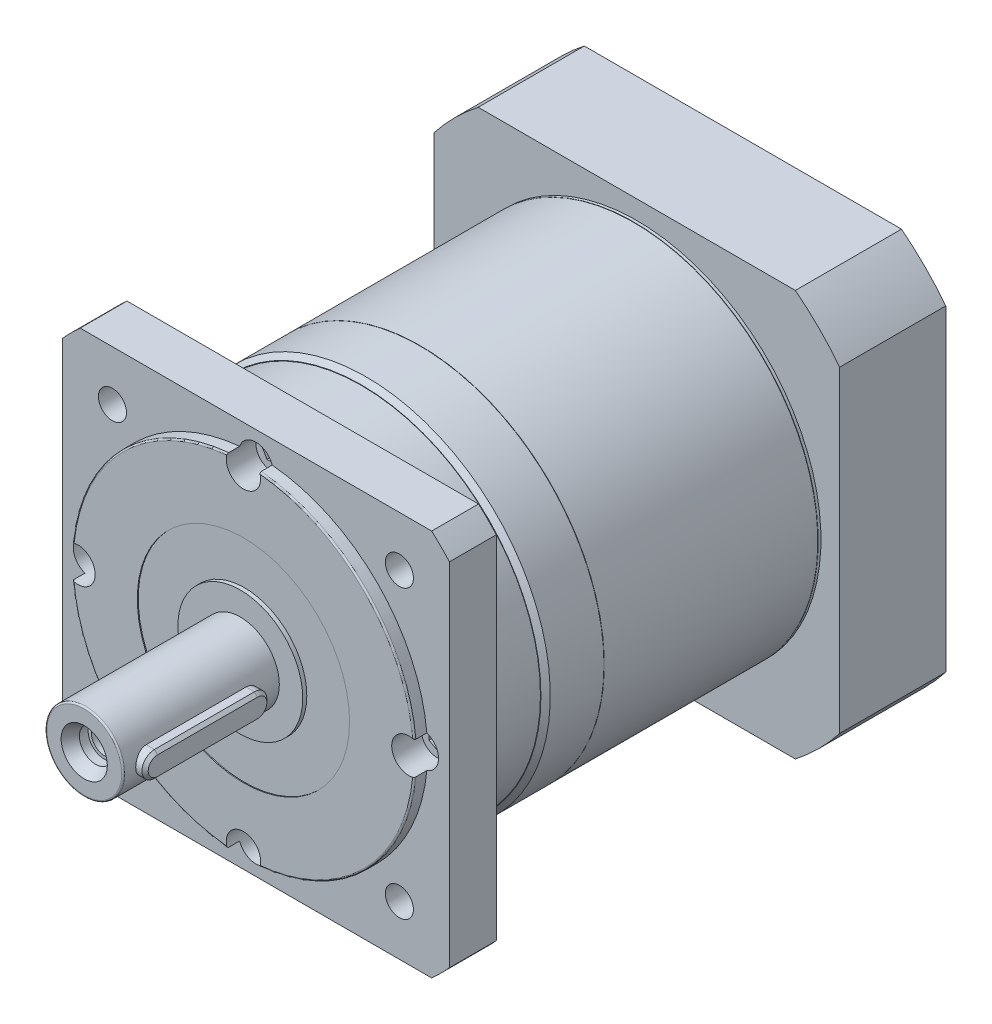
from build123d import *

# Parameters (mm, degrees)
SKETCH_1_R               = 59
EXTRUDE_1_DEPTH          = 56.5
SKETCH_2_OUTSIDE_W       = 155.236
SKETCH_2_OUTSIDE_H       = 155.236
SKETCH_2_OUTSIDE_R       = 55
CUT_EXTRUDE_1_DEPTH      = 4
SKETCH_4_R               = 59
EXTRUDE_2_DEPTH          = 68.4
SKETCH_5_R               = 59
EXTRUDE_3_DEPTH          = 0.9
EXTRUDE_4_DEPTH          = 34
CUT_EXTRUDE_START        = -8
SKETCH_7_R               = 55
CUT_EXTRUDE_3_DEPTH      = 8
SKETCH_8_R               = 39
CUT_EXTRUDE_4_DEPTH      = 30
SKETCH_9_R               = 5.5
CUT_EXTRUDE_5_DEPTH      = 18
PATTERN_CIRCULAR_1_COUNT = 6
PATTERN_CIRCULAR_2_COUNT = 4
FILLET_1_R               = 0.5
SKETCH_12_R              = 20
EXTRUDE_5_DEPTH          = 1
SKETCH_13_R              = 12.5
EXTRUDE_6_DEPTH          = 50
FILLET_2_R               = 0.5
SKETCH_14_R              = 5.5
CUT_EXTRUDE_6_DEPTH      = 11
PATTERN_CIRCULAR_3_COUNT = 4
SKETCH_15_R              = 5
EXTRUDE_7_DEPTH          = 6
PATTERN_CIRCULAR_4_COUNT = 4
SKETCH_16_R              = 5
EXTRUDE_8_DEPTH          = 6
PATTERN_CIRCULAR_5_COUNT = 6
SKETCH_17_R              = 32.5
EXTRUDE_9_DEPTH          = 23
CHAMFER_2_SIZE           = 1
SKETCH_18_W              = 71.157450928
SKETCH_18_H              = 1
CUT_EXTRUDE_7_DEPTH      = 23
SKETCH_19_R              = 11
CUT_EXTRUDE_8_DEPTH      = 59
EXTRUDE_10_DEPTH         = 15.5
CHAMFER_3_SIZE           = 1
EXTRUDE_START            = -15
SKETCH_23_R              = 59
EXTRUDE_11_DEPTH         = 15
SKETCH_24_OUTSIDE_W      = 187.972
SKETCH_24_OUTSIDE_H      = 187.972
SKETCH_24_OUTSIDE_R      = 57.35
CUT_EXTRUDE_9_DEPTH      = 18.8
CHAMFER_4_SIZE           = 1.5
SKETCH_25_R              = 4.5
CUT_EXTRUDE_10_DEPTH     = 18.8
PATTERN_CIRCULAR_6_COUNT = 4
SKETCH_27_R              = 5.5
CUT_EXTRUDE_11_DEPTH     = 4
PATTERN_CIRCULAR_7_COUNT = 4
CUT_EXTRUDE_START_2      = -0.3
SKETCH_28_R              = 34
SKETCH_28_R_2            = 20
CUT_EXTRUDE_12_DEPTH     = 0.3
SKETCH_29_R              = 5.25
CUT_EXTRUDE_13_DEPTH     = 6.5
SKETCH_30_R              = 7.4
SKETCH_31_R              = 5.25


with BuildPart() as part:
    # Sketch 1 → Extrude 1 (new body)
    with BuildSketch(Plane.XY):
        Circle(SKETCH_1_R)
    extrude(amount=EXTRUDE_1_DEPTH)

    # Sketch 2 outside → Cut-Extrude 1 (cut)
    with BuildSketch(Plane.XY.offset(56.5)):
        Rectangle(SKETCH_2_OUTSIDE_W, SKETCH_2_OUTSIDE_H)
        Circle(SKETCH_2_OUTSIDE_R, mode=Mode.SUBTRACT)
    extrude(amount=-CUT_EXTRUDE_1_DEPTH, mode=Mode.SUBTRACT)

    # Fillet 1
    fillet_1_edges = [part.edges().sort_by_distance(p)[0] for p in [
        (-55, 0, 56.5),
    ]]
    fillet(fillet_1_edges, radius=FILLET_1_R)

    # Sketch 12 → Extrude 5 (add)
    with BuildSketch(Plane.XY.offset(56.5)):
        Circle(SKETCH_12_R)
    extrude(amount=EXTRUDE_5_DEPTH)

    # Sketch 13 → Extrude 6 (add)
    with BuildSketch(Plane.XY.offset(57.5)):
        Circle(SKETCH_13_R)
    extrude(amount=EXTRUDE_6_DEPTH)

    # Fillet 2
    fillet_2_edges = [part.edges().sort_by_distance(p)[0] for p in [
        (-12.5, 0, 107.5),
    ]]
    fillet(fillet_2_edges, radius=FILLET_2_R)

    # Sketch 14 → Cut-Extrude 6 (cut)
    with BuildSketch(Plane.XY.offset(52.5)):
        with Locations((0, -53)):
            Circle(SKETCH_14_R)
    cut_extrude_6 = extrude(amount=-CUT_EXTRUDE_6_DEPTH, mode=Mode.SUBTRACT)

    # Pattern Circular 3: Cut-Extrude 6 ×4 about axis
    pattern_circular_3_axis = Axis((0, 0, 0), (0, 0, 1))
    for i in range(1, PATTERN_CIRCULAR_3_COUNT):
        add(cut_extrude_6.rotate(pattern_circular_3_axis, i * 360 / PATTERN_CIRCULAR_3_COUNT), mode=Mode.SUBTRACT)

    # Sketch 15 → Extrude 7 (add)
    with BuildSketch(Plane.XY.offset(41.5)):
        with Locations((0, -53)):
            Circle(SKETCH_15_R)
        Polygon((1.459547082, -50.509406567), (-1.427143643, -50.490698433), (-2.886690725, -52.981291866), (-1.459547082, -55.490593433), (1.427143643, -55.509301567), (2.886690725, -53.018708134), align=None, mode=Mode.SUBTRACT)
    extrude_7 = extrude(amount=EXTRUDE_7_DEPTH)

    # Pattern Circular 4: Extrude 7 ×4 about axis
    pattern_circular_4_axis = Axis((0, 0, 0), (0, 0, 1))
    for i in range(1, PATTERN_CIRCULAR_4_COUNT):
        add(extrude_7.rotate(pattern_circular_4_axis, i * 360 / PATTERN_CIRCULAR_4_COUNT))

    # Sketch 22 → Extrude 10 (add)
    with BuildSketch(Plane(origin=(0, 0, 0), x_dir=(0, 0, -1), z_dir=(1, 0, 0))):
        with BuildLine():
            Line((-99.5, 4), (-67.5, 4))
            ThreePointArc((-67.5, 4), (-63.5, 0), (-67.5, -4))
            Line((-67.5, -4), (-99.5, -4))
            ThreePointArc((-99.5, -4), (-103.5, 0), (-99.5, 4))
        make_face()
    extrude(amount=EXTRUDE_10_DEPTH)

    # Chamfer 3
    chamfer_3_edges = [part.edges().sort_by_distance(p)[0] for p in [
        (15.5, 0, 103.5),
        (15.5, -4, 83.5),
        (15.5, 0, 63.5),
        (15.5, 4, 83.5),
    ]]
    chamfer(chamfer_3_edges, length=CHAMFER_3_SIZE)

    # Sketch 23 → Extrude 11 (add)
    with BuildSketch(Plane.XY.offset(52.5).offset(EXTRUDE_START)):
        with BuildLine():
            Line((-56.303308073, 62), (56.303308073, 62))
            ThreePointArc((56.303308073, 62), (59.220192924, 59.220192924), (62, 56.303308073))
            Line((62, 56.303308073), (62, -56.303308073))
            ThreePointArc((62, -56.303308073), (59.220192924, -59.220192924), (56.303308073, -62))
            Line((56.303308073, -62), (-56.303308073, -62))
            ThreePointArc((-56.303308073, -62), (-59.220192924, -59.220192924), (-62, -56.303308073))
            Line((-62, -56.303308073), (-62, 56.303308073))
            ThreePointArc((-62, 56.303308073), (-59.220192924, 59.220192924), (-56.303308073, 62))
        make_face()
        with Locations(Location((0, 0, 0), (0, 0, 180))):
            Circle(SKETCH_23_R, mode=Mode.SUBTRACT)
    extrude(amount=EXTRUDE_11_DEPTH)

    # Sketch 24 outside → Cut-Extrude 9 (cut)
    with BuildSketch(Plane(origin=(0, 0, 37.5), x_dir=(-1, 0, 0), z_dir=(0, 0, -1))):
        Rectangle(SKETCH_24_OUTSIDE_W, SKETCH_24_OUTSIDE_H)
        Circle(SKETCH_24_OUTSIDE_R, mode=Mode.SUBTRACT)
    extrude(amount=CUT_EXTRUDE_9_DEPTH, mode=Mode.SUBTRACT)

    # Chamfer 4
    chamfer_4_edges = [part.edges().sort_by_distance(p)[0] for p in [
        (-59, 0, 18.7),
    ]]
    chamfer(chamfer_4_edges, length=CHAMFER_4_SIZE)

    # Sketch 25 → Cut-Extrude 10 (cut)
    with BuildSketch(Plane.XY.offset(52.5)):
        with Locations((-45.961940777, 45.961940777)):
            Circle(SKETCH_25_R)
    cut_extrude_10 = extrude(amount=-CUT_EXTRUDE_10_DEPTH, mode=Mode.SUBTRACT)

    # Pattern Circular 6: Cut-Extrude 10 ×4 about axis
    pattern_circular_6_axis = Axis((0, 0, 0), (0, 0, 1))
    for i in range(1, PATTERN_CIRCULAR_6_COUNT):
        add(cut_extrude_10.rotate(pattern_circular_6_axis, i * 360 / PATTERN_CIRCULAR_6_COUNT), mode=Mode.SUBTRACT)

    # Sketch 27 → Cut-Extrude 11 (cut)
    with BuildSketch(Plane.XY.offset(56.5)):
        with Locations(Location((-53, 0, 0), (0, 0, 270))):
            Circle(SKETCH_27_R)
    cut_extrude_11 = extrude(amount=-CUT_EXTRUDE_11_DEPTH, mode=Mode.SUBTRACT)

    # Pattern Circular 7: Cut-Extrude 11 ×4 about axis
    pattern_circular_7_axis = Axis((0, 0, 52.5), (0, 0, 1))
    for i in range(1, PATTERN_CIRCULAR_7_COUNT):
        add(cut_extrude_11.rotate(pattern_circular_7_axis, i * 360 / PATTERN_CIRCULAR_7_COUNT), mode=Mode.SUBTRACT)

    # Sketch 28 → Cut-Extrude 12 (cut)
    with BuildSketch(Plane.XY.offset(56.5).offset(CUT_EXTRUDE_START_2)):
        Circle(SKETCH_28_R)
        Circle(SKETCH_28_R_2, mode=Mode.SUBTRACT)
    extrude(amount=CUT_EXTRUDE_12_DEPTH, mode=Mode.SUBTRACT)

    # Sketch 29 → Cut-Extrude 13 (cut)
    with BuildSketch(Plane.XY.offset(107.5)):
        Circle(SKETCH_29_R)
    extrude(amount=-CUT_EXTRUDE_13_DEPTH, mode=Mode.SUBTRACT)

    # Sketch 30 → Loft 1 section 0
    with BuildSketch(Plane.XY.offset(107.5)):
        Circle(SKETCH_30_R)
    # Sketch 31 → Loft 1 section 1
    with BuildSketch(Plane.XY.offset(103.8)):
        Circle(SKETCH_31_R)
    loft(mode=Mode.SUBTRACT)

    # Sketch 32 → Hole Wizard M10 _1 (revolve, cut)
    with BuildSketch(Plane(origin=(0, 0, 101), x_dir=(0, -1, 0), z_dir=(1, 0, 0))):
        Polygon((0, 0), (0, 26.553657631), (4.25, 24), (4.25, 0), align=None)
    revolve(axis=Axis((0, 0, 107.35), (0, 0, -1)), mode=Mode.SUBTRACT)


with BuildPart() as body_2:
    # Sketch 4 → Extrude 2 (new body)
    with BuildSketch(Plane(origin=(0, 0, -0.1), x_dir=(-1, 0, 0), z_dir=(0, 0, -1))):
        Circle(SKETCH_4_R)
    extrude(amount=EXTRUDE_2_DEPTH)


with BuildPart() as body_3:
    # Sketch 5 → Extrude 3 (new body)
    with BuildSketch(Plane(origin=(0, 0, -68.6), x_dir=(-1, 0, 0), z_dir=(0, 0, -1))):
        Circle(SKETCH_5_R)
    extrude(amount=EXTRUDE_3_DEPTH)

    # Sketch 6 → Extrude 4 (add)
    with BuildSketch(Plane(origin=(0, 0, -69.5), x_dir=(-1, 0, 0), z_dir=(0, 0, -1))):
        with BuildLine():
            Line((-50.806003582, 65), (50.806003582, 65))
            ThreePointArc((50.806003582, 65), (58.336309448, 58.336309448), (65, 50.806003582))
            Line((65, 50.806003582), (65, -50.806003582))
            ThreePointArc((65, -50.806003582), (58.336309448, -58.336309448), (50.806003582, -65))
            Line((50.806003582, -65), (-50.806003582, -65))
            ThreePointArc((-50.806003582, -65), (-58.336309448, -58.336309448), (-65, -50.806003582))
            Line((-65, -50.806003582), (-65, 50.806003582))
            ThreePointArc((-65, 50.806003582), (-58.336309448, 58.336309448), (-50.806003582, 65))
        make_face()
    extrude(amount=EXTRUDE_4_DEPTH)

    # Sketch 7 → Cut-Extrude 3 (cut)
    with BuildSketch(Plane(origin=(0, 0, -103.5), x_dir=(-1, 0, 0), z_dir=(0, 0, -1)).offset(CUT_EXTRUDE_START)):
        Circle(SKETCH_7_R)
    extrude(amount=CUT_EXTRUDE_3_DEPTH, mode=Mode.SUBTRACT)


with BuildPart() as cut_extrude_4_tool:
    # Sketch 8 → Cut-Extrude 4 (new body)
    with BuildSketch(Plane(origin=(0, 0, -95.5), x_dir=(-1, 0, 0), z_dir=(0, 0, -1))):
        Circle(SKETCH_8_R)
    extrude(amount=-CUT_EXTRUDE_4_DEPTH)


with BuildPart() as body_2_1:
    add(body_2.part)

    # Cut-Extrude 4: cut by cut_extrude_4_tool
    add(cut_extrude_4_tool.part, mode=Mode.SUBTRACT)

    # Sketch 17 → Extrude 9 (add)
    with BuildSketch(Plane(origin=(0, 0, -88.5), x_dir=(-1, 0, 0), z_dir=(0, 0, -1))):
        Circle(SKETCH_17_R)
    extrude(amount=-EXTRUDE_9_DEPTH)

    # Chamfer 2
    chamfer_2_edges = [body_2_1.edges().sort_by_distance(p)[0] for p in [
        (32.5, 0, -88.5),
    ]]
    chamfer(chamfer_2_edges, length=CHAMFER_2_SIZE)

    # Sketch 18 → Cut-Extrude 7 (cut)
    with BuildSketch(Plane(origin=(0, 0, -88.5), x_dir=(-1, 0, 0), z_dir=(0, 0, -1))):
        with Locations((-0.10695181, 0)):
            Rectangle(SKETCH_18_W, SKETCH_18_H)
    extrude(amount=-CUT_EXTRUDE_7_DEPTH, mode=Mode.SUBTRACT)

    # Sketch 19 → Cut-Extrude 8 (cut)
    with BuildSketch(Plane(origin=(0, 0, -103.5), x_dir=(-1, 0, 0), z_dir=(0, 0, -1))):
        Circle(SKETCH_19_R)
    extrude(amount=-CUT_EXTRUDE_8_DEPTH, mode=Mode.SUBTRACT)


with BuildPart() as body_3_1:
    add(body_3.part)

    # Cut-Extrude 4: cut by cut_extrude_4_tool
    add(cut_extrude_4_tool.part, mode=Mode.SUBTRACT)

    # Sketch 9 → Cut-Extrude 5 (cut)
    with BuildSketch(Plane(origin=(0, 0, -103.5), x_dir=(-1, 0, 0), z_dir=(0, 0, -1))):
        with Locations((-53.5, 0)):
            Circle(SKETCH_9_R)
    cut_extrude_5 = extrude(amount=-CUT_EXTRUDE_5_DEPTH, mode=Mode.SUBTRACT)

    # Pattern Circular 1: Cut-Extrude 5 ×6 about axis
    pattern_circular_1_axis = Axis((0, 0, 0), (0, 0, 1))
    for i in range(1, PATTERN_CIRCULAR_1_COUNT):
        add(cut_extrude_5.rotate(pattern_circular_1_axis, i * 360 / PATTERN_CIRCULAR_1_COUNT), mode=Mode.SUBTRACT)

    # Sketch 11 → Hole Wizard M8 _1 (revolve, cut)
    with BuildSketch(Plane(origin=(51.265241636, 51.265241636, -103.5), x_dir=(0, 1, 0), z_dir=(1, 0, 0))):
        Polygon((0, 0), (0, 32.042926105), (3.4, 30), (3.4, 0), align=None)
    hole_wizard_m8_1 = revolve(axis=Axis((51.265241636, 51.265241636, -109.85), (0, 0, 1)), mode=Mode.SUBTRACT)

    # Pattern Circular 2: Hole Wizard M8 _1 ×4 about axis
    pattern_circular_2_axis = Axis((0, 0, 0), (0, 0, 1))
    for i in range(1, PATTERN_CIRCULAR_2_COUNT):
        add(hole_wizard_m8_1.rotate(pattern_circular_2_axis, i * 360 / PATTERN_CIRCULAR_2_COUNT), mode=Mode.SUBTRACT)

    # Sketch 16 → Extrude 8 (add)
    with BuildSketch(Plane(origin=(0, 0, -85.5), x_dir=(-1, 0, 0), z_dir=(0, 0, -1))):
        with Locations((-53.5, 0)):
            Circle(SKETCH_16_R)
        Polygon((-51.865292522, 2.379299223), (-54.743179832, 2.605347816), (-56.37788731, 0.226048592), (-55.134707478, -2.379299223), (-52.256820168, -2.605347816), (-50.62211269, -0.226048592), align=None, mode=Mode.SUBTRACT)
    extrude_8 = extrude(amount=EXTRUDE_8_DEPTH)

    # Pattern Circular 5: Extrude 8 ×6 about axis
    pattern_circular_5_axis = Axis((0, 0, 0), (0, 0, 1))
    for i in range(1, PATTERN_CIRCULAR_5_COUNT):
        add(extrude_8.rotate(pattern_circular_5_axis, i * 360 / PATTERN_CIRCULAR_5_COUNT))


solid = Compound([part.part, body_2_1.part, body_3_1.part])
